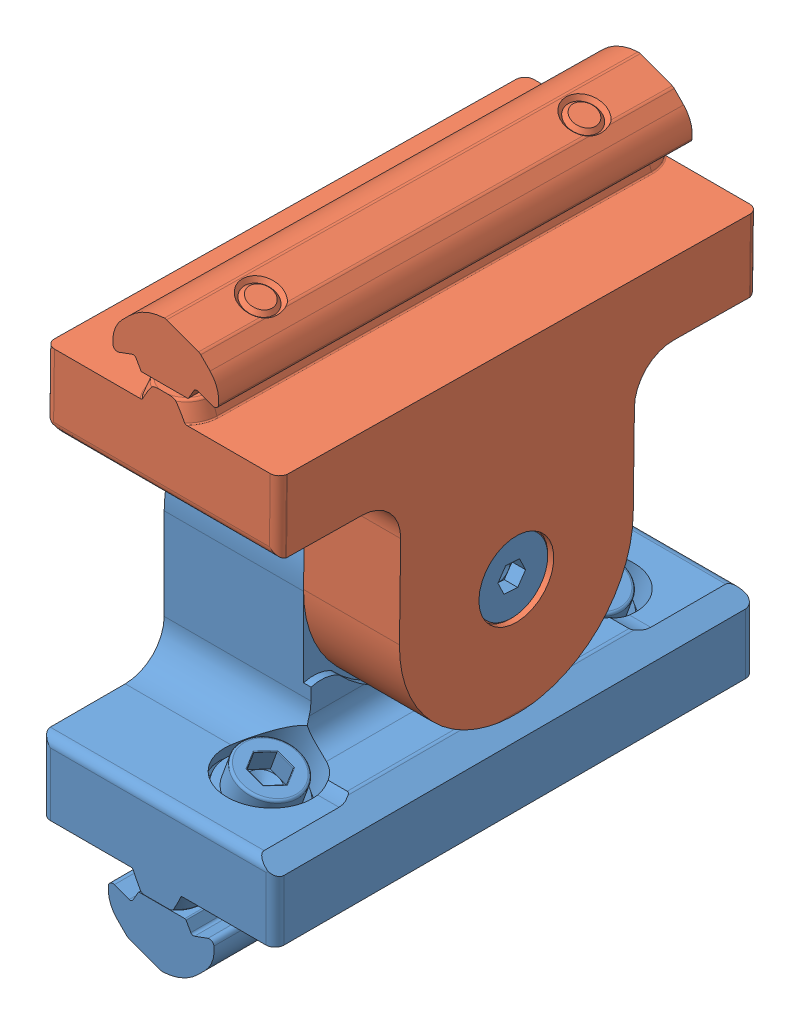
SolidWorks assembly Assem6.sldasm, configuration Standard (file format 13000). Lengths in mm.
Overall size (39.52 93.99 80.87).
2 component instances, 2 part files, 2 mates.
Components (placement in the parent):
- 40mm Pivot Bracket Profile Mount Bearing Side-1: 40mm Pivot Bracket Profile Mount Bearing Side.SLDPRT [Standard] at (-17.8094 9.1275 6.6678) size (39.27 66.24 80)
- 40mm Pivot Bracket Profile Mount Axle Side-1: 40mm Pivot Bracket Profile Mount Axle Side.SLDPRT [Standard] at (-35.724 67.0887 -23.8629) x (-1 0 0) z (0 0.013171 0.999913) size (39 66.24 80)
Mates (geometry in assembly coordinates):
- Concentric1: concentric aligned: cylinder of 40mm Pivot Bracket Profile Mount Bearing Side-1 through (-37.6636 8.5201 35.2578) axis (1 0 0) radius 14.975; cylinder of 40mm Pivot Bracket Profile Mount Axle Side-1 through (-40.3696 8.5201 35.2578) axis (1 0 0) radius 14.9746
- Coincident1: coincident anti-aligned: plane of 40mm Pivot Bracket Profile Mount Bearing Side-1 through (-56.3696 -10.7299 53.1044) normal (1 0 0); plane of 40mm Pivot Bracket Profile Mount Axle Side-1 through (-56.3696 28.0035 52.8493) normal (-1 0 0)
